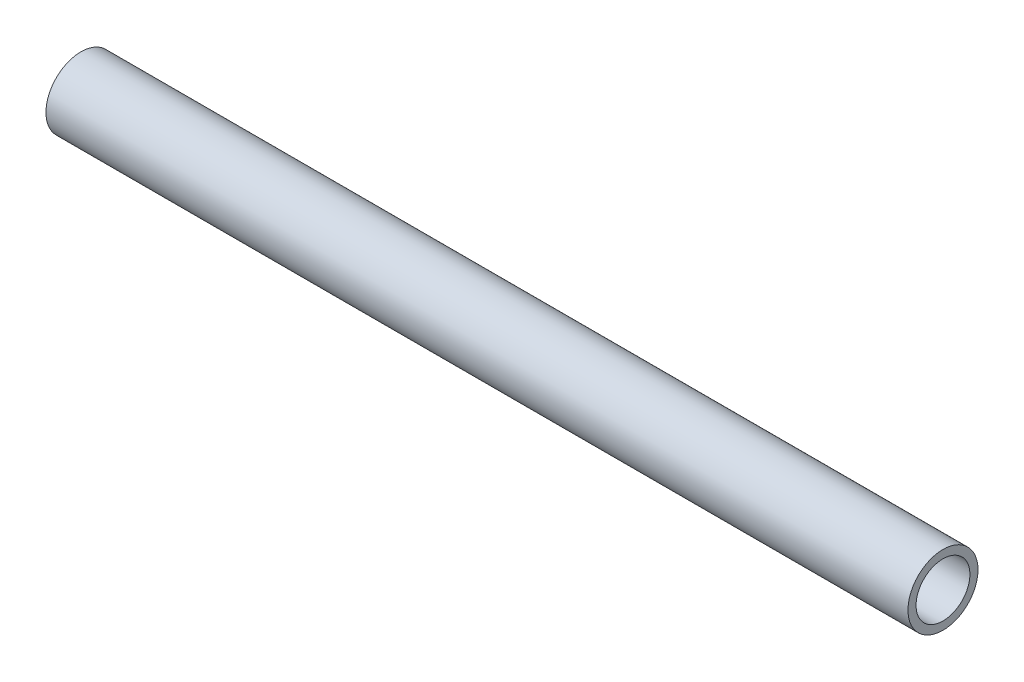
ISO-10303-21;
HEADER;
FILE_DESCRIPTION(('STEP AP214'),'2;1');
FILE_NAME('part.step','',(''),(''),'','','');
FILE_SCHEMA(('AUTOMOTIVE_DESIGN { 1 0 10303 214 1 1 1 1 }'));
ENDSEC;
DATA;
#1=APPLICATION_CONTEXT('core data for automotive mechanical design processes');
#2=APPLICATION_PROTOCOL_DEFINITION('international standard','automotive_design',2000,#1);
#3=PRODUCT_CONTEXT('',#1,'mechanical');
#4=PRODUCT('Part','Part','',(#3));
#5=PRODUCT_RELATED_PRODUCT_CATEGORY('part','',(#4));
#6=PRODUCT_DEFINITION_FORMATION('','',#4);
#7=PRODUCT_DEFINITION_CONTEXT('part definition',#1,'design');
#8=PRODUCT_DEFINITION('design','',#6,#7);
#9=PRODUCT_DEFINITION_SHAPE('','',#8);
#10=(LENGTH_UNIT() NAMED_UNIT(*) SI_UNIT(.MILLI.,.METRE.));
#11=(NAMED_UNIT(*) PLANE_ANGLE_UNIT() SI_UNIT($,.RADIAN.));
#12=(NAMED_UNIT(*) SI_UNIT($,.STERADIAN.) SOLID_ANGLE_UNIT());
#13=UNCERTAINTY_MEASURE_WITH_UNIT(LENGTH_MEASURE(1.E-05),#10,'distance_accuracy_value','');
#14=(GEOMETRIC_REPRESENTATION_CONTEXT(3) GLOBAL_UNCERTAINTY_ASSIGNED_CONTEXT((#13)) GLOBAL_UNIT_ASSIGNED_CONTEXT((#10,
#11,#12)) REPRESENTATION_CONTEXT('',''));
#15=CARTESIAN_POINT('',(0.,0.,0.));
#16=DIRECTION('',(0.,0.,1.));
#17=DIRECTION('',(1.,0.,0.));
#18=AXIS2_PLACEMENT_3D('',#15,#16,#17);
#19=CARTESIAN_POINT('',(406.4,0.,0.));
#20=DIRECTION('',(-1.,0.,0.));
#21=DIRECTION('',(0.,0.,1.));
#22=AXIS2_PLACEMENT_3D('',#19,#20,#21);
#23=CYLINDRICAL_SURFACE('',#22,12.7);
#24=CARTESIAN_POINT('',(406.4,0.,0.));
#25=DIRECTION('',(1.,0.,0.));
#26=DIRECTION('',(0.,0.,-1.));
#27=AXIS2_PLACEMENT_3D('',#24,#25,#26);
#28=CIRCLE('',#27,12.7);
#29=CARTESIAN_POINT('',(406.4,0.,-12.7));
#30=VERTEX_POINT('',#29);
#31=EDGE_CURVE('E53',#30,#30,#28,.T.);
#32=ORIENTED_EDGE('',*,*,#31,.T.);
#33=EDGE_LOOP('',(#32));
#34=FACE_BOUND('',#33,.T.);
#35=CARTESIAN_POINT('',(0.,0.,0.));
#36=DIRECTION('',(1.,0.,0.));
#37=DIRECTION('',(0.,0.,-1.));
#38=AXIS2_PLACEMENT_3D('',#35,#36,#37);
#39=CIRCLE('',#38,12.7);
#40=CARTESIAN_POINT('',(0.,0.,-12.7));
#41=VERTEX_POINT('',#40);
#42=EDGE_CURVE('E60',#41,#41,#39,.T.);
#43=ORIENTED_EDGE('',*,*,#42,.F.);
#44=EDGE_LOOP('',(#43));
#45=FACE_BOUND('',#44,.T.);
#46=ADVANCED_FACE('F45',(#34,#45),#23,.F.);
#47=CARTESIAN_POINT('',(406.4,0.,0.));
#48=DIRECTION('',(-1.,0.,0.));
#49=DIRECTION('',(0.,0.,1.));
#50=AXIS2_PLACEMENT_3D('',#47,#48,#49);
#51=CYLINDRICAL_SURFACE('',#50,16.51);
#52=CARTESIAN_POINT('',(406.4,0.,0.));
#53=DIRECTION('',(1.,0.,0.));
#54=DIRECTION('',(0.,0.,-1.));
#55=AXIS2_PLACEMENT_3D('',#52,#53,#54);
#56=CIRCLE('',#55,16.51);
#57=CARTESIAN_POINT('',(406.4,0.,-16.51));
#58=VERTEX_POINT('',#57);
#59=EDGE_CURVE('E10',#58,#58,#56,.T.);
#60=ORIENTED_EDGE('',*,*,#59,.F.);
#61=EDGE_LOOP('',(#60));
#62=FACE_BOUND('',#61,.T.);
#63=CARTESIAN_POINT('',(0.,0.,0.));
#64=DIRECTION('',(1.,0.,0.));
#65=DIRECTION('',(0.,0.,-1.));
#66=AXIS2_PLACEMENT_3D('',#63,#64,#65);
#67=CIRCLE('',#66,16.51);
#68=CARTESIAN_POINT('',(0.,0.,-16.51));
#69=VERTEX_POINT('',#68);
#70=EDGE_CURVE('E48',#69,#69,#67,.T.);
#71=ORIENTED_EDGE('',*,*,#70,.T.);
#72=EDGE_LOOP('',(#71));
#73=FACE_BOUND('',#72,.T.);
#74=ADVANCED_FACE('F69',(#62,#73),#51,.T.);
#75=CARTESIAN_POINT('',(406.4,0.,0.));
#76=DIRECTION('',(1.,0.,0.));
#77=DIRECTION('',(0.,0.,-1.));
#78=AXIS2_PLACEMENT_3D('',#75,#76,#77);
#79=PLANE('',#78);
#80=ORIENTED_EDGE('',*,*,#31,.F.);
#81=EDGE_LOOP('',(#80));
#82=FACE_BOUND('',#81,.T.);
#83=ORIENTED_EDGE('',*,*,#59,.T.);
#84=EDGE_LOOP('',(#83));
#85=FACE_BOUND('',#84,.T.);
#86=ADVANCED_FACE('F73',(#82,#85),#79,.T.);
#87=CARTESIAN_POINT('',(0.,0.,0.));
#88=DIRECTION('',(1.,0.,0.));
#89=DIRECTION('',(0.,0.,-1.));
#90=AXIS2_PLACEMENT_3D('',#87,#88,#89);
#91=PLANE('',#90);
#92=ORIENTED_EDGE('',*,*,#42,.T.);
#93=EDGE_LOOP('',(#92));
#94=FACE_BOUND('',#93,.T.);
#95=ORIENTED_EDGE('',*,*,#70,.F.);
#96=EDGE_LOOP('',(#95));
#97=FACE_BOUND('',#96,.T.);
#98=ADVANCED_FACE('F71',(#94,#97),#91,.F.);
#99=CLOSED_SHELL('',(#46,#74,#86,#98));
#100=MANIFOLD_SOLID_BREP('B2',#99);
#101=ADVANCED_BREP_SHAPE_REPRESENTATION('',(#18,#100),#14);
#102=SHAPE_DEFINITION_REPRESENTATION(#9,#101);
ENDSEC;
END-ISO-10303-21;
